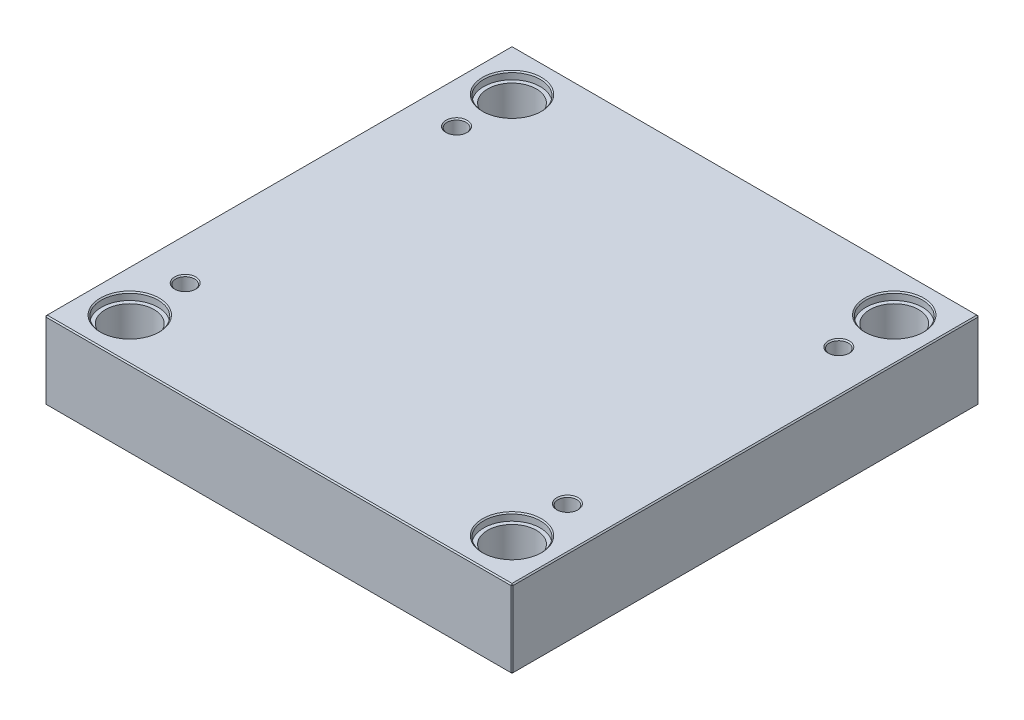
ISO-10303-21;
HEADER;
FILE_DESCRIPTION(('STEP AP214'),'2;1');
FILE_NAME('part.step','',(''),(''),'','','');
FILE_SCHEMA(('AUTOMOTIVE_DESIGN { 1 0 10303 214 1 1 1 1 }'));
ENDSEC;
DATA;
#1=APPLICATION_CONTEXT('core data for automotive mechanical design processes');
#2=APPLICATION_PROTOCOL_DEFINITION('international standard','automotive_design',2000,#1);
#3=PRODUCT_CONTEXT('',#1,'mechanical');
#4=PRODUCT('Part','Part','',(#3));
#5=PRODUCT_RELATED_PRODUCT_CATEGORY('part','',(#4));
#6=PRODUCT_DEFINITION_FORMATION('','',#4);
#7=PRODUCT_DEFINITION_CONTEXT('part definition',#1,'design');
#8=PRODUCT_DEFINITION('design','',#6,#7);
#9=PRODUCT_DEFINITION_SHAPE('','',#8);
#10=(LENGTH_UNIT() NAMED_UNIT(*) SI_UNIT(.MILLI.,.METRE.));
#11=(NAMED_UNIT(*) PLANE_ANGLE_UNIT() SI_UNIT($,.RADIAN.));
#12=(NAMED_UNIT(*) SI_UNIT($,.STERADIAN.) SOLID_ANGLE_UNIT());
#13=UNCERTAINTY_MEASURE_WITH_UNIT(LENGTH_MEASURE(1.E-05),#10,'distance_accuracy_value','');
#14=(GEOMETRIC_REPRESENTATION_CONTEXT(3) GLOBAL_UNCERTAINTY_ASSIGNED_CONTEXT((#13)) GLOBAL_UNIT_ASSIGNED_CONTEXT((#10,
#11,#12)) REPRESENTATION_CONTEXT('',''));
#15=CARTESIAN_POINT('',(0.,0.,0.));
#16=DIRECTION('',(0.,0.,1.));
#17=DIRECTION('',(1.,0.,0.));
#18=AXIS2_PLACEMENT_3D('',#15,#16,#17);
#19=CARTESIAN_POINT('',(-162.,0.,-162.));
#20=DIRECTION('',(0.,1.,0.));
#21=DIRECTION('',(0.,0.,1.));
#22=AXIS2_PLACEMENT_3D('',#19,#20,#21);
#23=CYLINDRICAL_SURFACE('',#22,20.65);
#24=CARTESIAN_POINT('',(-162.,0.999999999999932,-162.));
#25=DIRECTION('',(0.,1.,0.));
#26=DIRECTION('',(0.,0.,1.));
#27=AXIS2_PLACEMENT_3D('',#24,#25,#26);
#28=CIRCLE('',#27,20.65);
#29=CARTESIAN_POINT('',(-162.,0.999999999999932,-141.35));
#30=VERTEX_POINT('',#29);
#31=EDGE_CURVE('E472',#30,#30,#28,.F.);
#32=ORIENTED_EDGE('',*,*,#31,.T.);
#33=EDGE_LOOP('',(#32));
#34=FACE_BOUND('',#33,.T.);
#35=CARTESIAN_POINT('',(-162.,59.7,-162.));
#36=DIRECTION('',(0.,1.,0.));
#37=DIRECTION('',(0.,0.,1.));
#38=AXIS2_PLACEMENT_3D('',#35,#36,#37);
#39=CIRCLE('',#38,20.65);
#40=CARTESIAN_POINT('',(-162.,59.7,-141.35));
#41=VERTEX_POINT('',#40);
#42=EDGE_CURVE('E221',#41,#41,#39,.F.);
#43=ORIENTED_EDGE('',*,*,#42,.F.);
#44=EDGE_LOOP('',(#43));
#45=FACE_BOUND('',#44,.T.);
#46=ADVANCED_FACE('F16',(#34,#45),#23,.F.);
#47=CARTESIAN_POINT('',(162.,0.,-162.));
#48=DIRECTION('',(0.,1.,0.));
#49=DIRECTION('',(0.,0.,1.));
#50=AXIS2_PLACEMENT_3D('',#47,#48,#49);
#51=CYLINDRICAL_SURFACE('',#50,20.65);
#52=CARTESIAN_POINT('',(162.,0.999999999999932,-162.));
#53=DIRECTION('',(0.,1.,0.));
#54=DIRECTION('',(0.,0.,1.));
#55=AXIS2_PLACEMENT_3D('',#52,#53,#54);
#56=CIRCLE('',#55,20.65);
#57=CARTESIAN_POINT('',(162.,0.999999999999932,-141.35));
#58=VERTEX_POINT('',#57);
#59=EDGE_CURVE('E474',#58,#58,#56,.F.);
#60=ORIENTED_EDGE('',*,*,#59,.T.);
#61=EDGE_LOOP('',(#60));
#62=FACE_BOUND('',#61,.T.);
#63=CARTESIAN_POINT('',(162.,59.7,-162.));
#64=DIRECTION('',(0.,1.,0.));
#65=DIRECTION('',(0.,0.,1.));
#66=AXIS2_PLACEMENT_3D('',#63,#64,#65);
#67=CIRCLE('',#66,20.65);
#68=CARTESIAN_POINT('',(162.,59.7,-141.35));
#69=VERTEX_POINT('',#68);
#70=EDGE_CURVE('E218',#69,#69,#67,.F.);
#71=ORIENTED_EDGE('',*,*,#70,.F.);
#72=EDGE_LOOP('',(#71));
#73=FACE_BOUND('',#72,.T.);
#74=ADVANCED_FACE('F263',(#62,#73),#51,.F.);
#75=CARTESIAN_POINT('',(162.,0.,162.));
#76=DIRECTION('',(0.,1.,0.));
#77=DIRECTION('',(0.,0.,1.));
#78=AXIS2_PLACEMENT_3D('',#75,#76,#77);
#79=CYLINDRICAL_SURFACE('',#78,20.65);
#80=CARTESIAN_POINT('',(162.,0.999999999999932,162.));
#81=DIRECTION('',(0.,1.,0.));
#82=DIRECTION('',(0.,0.,1.));
#83=AXIS2_PLACEMENT_3D('',#80,#81,#82);
#84=CIRCLE('',#83,20.65);
#85=CARTESIAN_POINT('',(162.,0.999999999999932,182.65));
#86=VERTEX_POINT('',#85);
#87=EDGE_CURVE('E477',#86,#86,#84,.F.);
#88=ORIENTED_EDGE('',*,*,#87,.T.);
#89=EDGE_LOOP('',(#88));
#90=FACE_BOUND('',#89,.T.);
#91=CARTESIAN_POINT('',(162.,59.7,162.));
#92=DIRECTION('',(0.,1.,0.));
#93=DIRECTION('',(0.,0.,1.));
#94=AXIS2_PLACEMENT_3D('',#91,#92,#93);
#95=CIRCLE('',#94,20.65);
#96=CARTESIAN_POINT('',(162.,59.7,182.65));
#97=VERTEX_POINT('',#96);
#98=EDGE_CURVE('E214',#97,#97,#95,.F.);
#99=ORIENTED_EDGE('',*,*,#98,.F.);
#100=EDGE_LOOP('',(#99));
#101=FACE_BOUND('',#100,.T.);
#102=ADVANCED_FACE('F270',(#90,#101),#79,.F.);
#103=CARTESIAN_POINT('',(-162.,0.,162.));
#104=DIRECTION('',(0.,1.,0.));
#105=DIRECTION('',(0.,0.,1.));
#106=AXIS2_PLACEMENT_3D('',#103,#104,#105);
#107=CYLINDRICAL_SURFACE('',#106,20.65);
#108=CARTESIAN_POINT('',(-162.,0.999999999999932,162.));
#109=DIRECTION('',(0.,1.,0.));
#110=DIRECTION('',(0.,0.,1.));
#111=AXIS2_PLACEMENT_3D('',#108,#109,#110);
#112=CIRCLE('',#111,20.65);
#113=CARTESIAN_POINT('',(-162.,0.999999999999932,182.65));
#114=VERTEX_POINT('',#113);
#115=EDGE_CURVE('E480',#114,#114,#112,.F.);
#116=ORIENTED_EDGE('',*,*,#115,.T.);
#117=EDGE_LOOP('',(#116));
#118=FACE_BOUND('',#117,.T.);
#119=CARTESIAN_POINT('',(-162.,59.7,162.));
#120=DIRECTION('',(0.,1.,0.));
#121=DIRECTION('',(0.,0.,1.));
#122=AXIS2_PLACEMENT_3D('',#119,#120,#121);
#123=CIRCLE('',#122,20.65);
#124=CARTESIAN_POINT('',(-162.,59.7,182.65));
#125=VERTEX_POINT('',#124);
#126=EDGE_CURVE('E211',#125,#125,#123,.F.);
#127=ORIENTED_EDGE('',*,*,#126,.F.);
#128=EDGE_LOOP('',(#127));
#129=FACE_BOUND('',#128,.T.);
#130=ADVANCED_FACE('F277',(#118,#129),#107,.F.);
#131=CARTESIAN_POINT('',(-198.,66.,198.));
#132=DIRECTION('',(1.,0.,0.));
#133=DIRECTION('',(0.,0.,-1.));
#134=AXIS2_PLACEMENT_3D('',#131,#132,#133);
#135=PLANE('',#134);
#136=DIRECTION('',(0.,-1.,0.));
#137=VECTOR('',#136,1.);
#138=CARTESIAN_POINT('',(-198.,66.,-197.));
#139=LINE('',#138,#137);
#140=CARTESIAN_POINT('',(-198.,65.,-197.));
#141=VERTEX_POINT('',#140);
#142=CARTESIAN_POINT('',(-198.,0.999999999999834,-197.));
#143=VERTEX_POINT('',#142);
#144=EDGE_CURVE('E487',#141,#143,#139,.T.);
#145=ORIENTED_EDGE('',*,*,#144,.T.);
#146=DIRECTION('',(0.,0.,1.));
#147=VECTOR('',#146,1.);
#148=CARTESIAN_POINT('',(-198.,0.999999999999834,198.));
#149=LINE('',#148,#147);
#150=CARTESIAN_POINT('',(-198.,0.999999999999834,197.));
#151=VERTEX_POINT('',#150);
#152=EDGE_CURVE('E490',#143,#151,#149,.T.);
#153=ORIENTED_EDGE('',*,*,#152,.T.);
#154=DIRECTION('',(0.,1.,0.));
#155=VECTOR('',#154,1.);
#156=CARTESIAN_POINT('',(-198.,66.,197.));
#157=LINE('',#156,#155);
#158=CARTESIAN_POINT('',(-198.,65.,197.));
#159=VERTEX_POINT('',#158);
#160=EDGE_CURVE('E485',#151,#159,#157,.T.);
#161=ORIENTED_EDGE('',*,*,#160,.T.);
#162=DIRECTION('',(0.,0.,-1.));
#163=VECTOR('',#162,1.);
#164=CARTESIAN_POINT('',(-198.,65.,-198.));
#165=LINE('',#164,#163);
#166=EDGE_CURVE('E483',#159,#141,#165,.T.);
#167=ORIENTED_EDGE('',*,*,#166,.T.);
#168=EDGE_LOOP('',(#145,#153,#161,#167));
#169=FACE_BOUND('',#168,.T.);
#170=ADVANCED_FACE('F298',(#169),#135,.F.);
#171=CARTESIAN_POINT('',(198.,66.,198.));
#172=DIRECTION('',(0.,0.,-1.));
#173=DIRECTION('',(-1.,0.,0.));
#174=AXIS2_PLACEMENT_3D('',#171,#172,#173);
#175=PLANE('',#174);
#176=DIRECTION('',(-1.,0.,0.));
#177=VECTOR('',#176,1.);
#178=CARTESIAN_POINT('',(-198.,65.,198.));
#179=LINE('',#178,#177);
#180=CARTESIAN_POINT('',(197.,65.,198.));
#181=VERTEX_POINT('',#180);
#182=CARTESIAN_POINT('',(-197.,65.,198.));
#183=VERTEX_POINT('',#182);
#184=EDGE_CURVE('E509',#181,#183,#179,.T.);
#185=ORIENTED_EDGE('',*,*,#184,.T.);
#186=DIRECTION('',(0.,-1.,0.));
#187=VECTOR('',#186,1.);
#188=CARTESIAN_POINT('',(-197.,66.,198.));
#189=LINE('',#188,#187);
#190=CARTESIAN_POINT('',(-197.,0.99999999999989,198.));
#191=VERTEX_POINT('',#190);
#192=EDGE_CURVE('E515',#183,#191,#189,.T.);
#193=ORIENTED_EDGE('',*,*,#192,.T.);
#194=DIRECTION('',(1.,0.,0.));
#195=VECTOR('',#194,1.);
#196=CARTESIAN_POINT('',(198.,0.99999999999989,198.));
#197=LINE('',#196,#195);
#198=CARTESIAN_POINT('',(197.,0.99999999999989,198.));
#199=VERTEX_POINT('',#198);
#200=EDGE_CURVE('E513',#191,#199,#197,.T.);
#201=ORIENTED_EDGE('',*,*,#200,.T.);
#202=DIRECTION('',(0.,1.,0.));
#203=VECTOR('',#202,1.);
#204=CARTESIAN_POINT('',(197.,66.,198.));
#205=LINE('',#204,#203);
#206=EDGE_CURVE('E511',#199,#181,#205,.T.);
#207=ORIENTED_EDGE('',*,*,#206,.T.);
#208=EDGE_LOOP('',(#185,#193,#201,#207));
#209=FACE_BOUND('',#208,.T.);
#210=ADVANCED_FACE('F294',(#209),#175,.F.);
#211=CARTESIAN_POINT('',(198.,66.,198.));
#212=DIRECTION('',(-1.,0.,0.));
#213=DIRECTION('',(0.,0.,1.));
#214=AXIS2_PLACEMENT_3D('',#211,#212,#213);
#215=PLANE('',#214);
#216=DIRECTION('',(0.,0.,-1.));
#217=VECTOR('',#216,1.);
#218=CARTESIAN_POINT('',(198.,0.99999999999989,198.));
#219=LINE('',#218,#217);
#220=CARTESIAN_POINT('',(198.,0.99999999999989,197.));
#221=VERTEX_POINT('',#220);
#222=CARTESIAN_POINT('',(198.,0.99999999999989,-197.));
#223=VERTEX_POINT('',#222);
#224=EDGE_CURVE('E504',#221,#223,#219,.T.);
#225=ORIENTED_EDGE('',*,*,#224,.T.);
#226=DIRECTION('',(0.,1.,0.));
#227=VECTOR('',#226,1.);
#228=CARTESIAN_POINT('',(198.,66.,-197.));
#229=LINE('',#228,#227);
#230=CARTESIAN_POINT('',(198.,65.,-197.));
#231=VERTEX_POINT('',#230);
#232=EDGE_CURVE('E506',#223,#231,#229,.T.);
#233=ORIENTED_EDGE('',*,*,#232,.T.);
#234=DIRECTION('',(0.,0.,1.));
#235=VECTOR('',#234,1.);
#236=CARTESIAN_POINT('',(198.,65.,198.));
#237=LINE('',#236,#235);
#238=CARTESIAN_POINT('',(198.,65.,197.));
#239=VERTEX_POINT('',#238);
#240=EDGE_CURVE('E500',#231,#239,#237,.T.);
#241=ORIENTED_EDGE('',*,*,#240,.T.);
#242=DIRECTION('',(0.,-1.,0.));
#243=VECTOR('',#242,1.);
#244=CARTESIAN_POINT('',(198.,66.,197.));
#245=LINE('',#244,#243);
#246=EDGE_CURVE('E502',#239,#221,#245,.T.);
#247=ORIENTED_EDGE('',*,*,#246,.T.);
#248=EDGE_LOOP('',(#225,#233,#241,#247));
#249=FACE_BOUND('',#248,.T.);
#250=ADVANCED_FACE('F290',(#249),#215,.F.);
#251=CARTESIAN_POINT('',(198.,66.,-198.));
#252=DIRECTION('',(0.,0.,1.));
#253=DIRECTION('',(1.,0.,0.));
#254=AXIS2_PLACEMENT_3D('',#251,#252,#253);
#255=PLANE('',#254);
#256=DIRECTION('',(0.,-1.,0.));
#257=VECTOR('',#256,1.);
#258=CARTESIAN_POINT('',(197.,66.,-198.));
#259=LINE('',#258,#257);
#260=CARTESIAN_POINT('',(197.,65.,-198.));
#261=VERTEX_POINT('',#260);
#262=CARTESIAN_POINT('',(197.,0.99999999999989,-198.));
#263=VERTEX_POINT('',#262);
#264=EDGE_CURVE('E494',#261,#263,#259,.T.);
#265=ORIENTED_EDGE('',*,*,#264,.T.);
#266=DIRECTION('',(-1.,0.,0.));
#267=VECTOR('',#266,1.);
#268=CARTESIAN_POINT('',(198.,0.99999999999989,-198.));
#269=LINE('',#268,#267);
#270=CARTESIAN_POINT('',(-197.,0.99999999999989,-198.));
#271=VERTEX_POINT('',#270);
#272=EDGE_CURVE('E138',#263,#271,#269,.T.);
#273=ORIENTED_EDGE('',*,*,#272,.T.);
#274=DIRECTION('',(0.,1.,0.));
#275=VECTOR('',#274,1.);
#276=CARTESIAN_POINT('',(-197.,66.,-198.));
#277=LINE('',#276,#275);
#278=CARTESIAN_POINT('',(-197.,65.,-198.));
#279=VERTEX_POINT('',#278);
#280=EDGE_CURVE('E496',#271,#279,#277,.T.);
#281=ORIENTED_EDGE('',*,*,#280,.T.);
#282=DIRECTION('',(1.,0.,0.));
#283=VECTOR('',#282,1.);
#284=CARTESIAN_POINT('',(198.,65.,-198.));
#285=LINE('',#284,#283);
#286=EDGE_CURVE('E492',#279,#261,#285,.T.);
#287=ORIENTED_EDGE('',*,*,#286,.T.);
#288=EDGE_LOOP('',(#265,#273,#281,#287));
#289=FACE_BOUND('',#288,.T.);
#290=ADVANCED_FACE('F282',(#289),#255,.F.);
#291=CARTESIAN_POINT('',(0.,66.,0.));
#292=DIRECTION('',(0.,1.,0.));
#293=DIRECTION('',(0.,0.,1.));
#294=AXIS2_PLACEMENT_3D('',#291,#292,#293);
#295=PLANE('',#294);
#296=CARTESIAN_POINT('',(162.,66.,162.));
#297=DIRECTION('',(0.,1.,0.));
#298=DIRECTION('',(0.,0.,1.));
#299=AXIS2_PLACEMENT_3D('',#296,#297,#298);
#300=CIRCLE('',#299,25.);
#301=CARTESIAN_POINT('',(162.,66.,187.));
#302=VERTEX_POINT('',#301);
#303=EDGE_CURVE('E236',#302,#302,#300,.F.);
#304=ORIENTED_EDGE('',*,*,#303,.T.);
#305=EDGE_LOOP('',(#304));
#306=FACE_BOUND('',#305,.T.);
#307=CARTESIAN_POINT('',(-162.,66.,162.));
#308=DIRECTION('',(0.,1.,0.));
#309=DIRECTION('',(0.,0.,1.));
#310=AXIS2_PLACEMENT_3D('',#307,#308,#309);
#311=CIRCLE('',#310,25.);
#312=CARTESIAN_POINT('',(-162.,66.,187.));
#313=VERTEX_POINT('',#312);
#314=EDGE_CURVE('E233',#313,#313,#311,.F.);
#315=ORIENTED_EDGE('',*,*,#314,.T.);
#316=EDGE_LOOP('',(#315));
#317=FACE_BOUND('',#316,.T.);
#318=CARTESIAN_POINT('',(162.,66.,-162.));
#319=DIRECTION('',(0.,1.,0.));
#320=DIRECTION('',(0.,0.,1.));
#321=AXIS2_PLACEMENT_3D('',#318,#319,#320);
#322=CIRCLE('',#321,25.);
#323=CARTESIAN_POINT('',(162.,66.,-137.));
#324=VERTEX_POINT('',#323);
#325=EDGE_CURVE('E230',#324,#324,#322,.F.);
#326=ORIENTED_EDGE('',*,*,#325,.T.);
#327=EDGE_LOOP('',(#326));
#328=FACE_BOUND('',#327,.T.);
#329=CARTESIAN_POINT('',(-162.,66.,-162.));
#330=DIRECTION('',(0.,1.,0.));
#331=DIRECTION('',(0.,0.,1.));
#332=AXIS2_PLACEMENT_3D('',#329,#330,#331);
#333=CIRCLE('',#332,25.);
#334=CARTESIAN_POINT('',(-162.,66.,-137.));
#335=VERTEX_POINT('',#334);
#336=EDGE_CURVE('E227',#335,#335,#333,.F.);
#337=ORIENTED_EDGE('',*,*,#336,.T.);
#338=EDGE_LOOP('',(#337));
#339=FACE_BOUND('',#338,.T.);
#340=CARTESIAN_POINT('',(-162.,66.,115.));
#341=DIRECTION('',(0.,1.,0.));
#342=DIRECTION('',(0.,0.,1.));
#343=AXIS2_PLACEMENT_3D('',#340,#341,#342);
#344=CIRCLE('',#343,9.);
#345=CARTESIAN_POINT('',(-162.,66.,124.));
#346=VERTEX_POINT('',#345);
#347=EDGE_CURVE('E198',#346,#346,#344,.F.);
#348=ORIENTED_EDGE('',*,*,#347,.T.);
#349=EDGE_LOOP('',(#348));
#350=FACE_BOUND('',#349,.T.);
#351=CARTESIAN_POINT('',(162.,66.,115.));
#352=DIRECTION('',(0.,1.,0.));
#353=DIRECTION('',(0.,0.,1.));
#354=AXIS2_PLACEMENT_3D('',#351,#352,#353);
#355=CIRCLE('',#354,9.);
#356=CARTESIAN_POINT('',(162.,66.,124.));
#357=VERTEX_POINT('',#356);
#358=EDGE_CURVE('E195',#357,#357,#355,.F.);
#359=ORIENTED_EDGE('',*,*,#358,.T.);
#360=EDGE_LOOP('',(#359));
#361=FACE_BOUND('',#360,.T.);
#362=CARTESIAN_POINT('',(162.,66.,-115.));
#363=DIRECTION('',(0.,1.,0.));
#364=DIRECTION('',(0.,0.,1.));
#365=AXIS2_PLACEMENT_3D('',#362,#363,#364);
#366=CIRCLE('',#365,9.);
#367=CARTESIAN_POINT('',(162.,66.,-106.));
#368=VERTEX_POINT('',#367);
#369=EDGE_CURVE('E192',#368,#368,#366,.F.);
#370=ORIENTED_EDGE('',*,*,#369,.T.);
#371=EDGE_LOOP('',(#370));
#372=FACE_BOUND('',#371,.T.);
#373=CARTESIAN_POINT('',(-162.,66.,-115.));
#374=DIRECTION('',(0.,1.,0.));
#375=DIRECTION('',(0.,0.,1.));
#376=AXIS2_PLACEMENT_3D('',#373,#374,#375);
#377=CIRCLE('',#376,9.);
#378=CARTESIAN_POINT('',(-162.,66.,-106.));
#379=VERTEX_POINT('',#378);
#380=EDGE_CURVE('E188',#379,#379,#377,.F.);
#381=ORIENTED_EDGE('',*,*,#380,.T.);
#382=EDGE_LOOP('',(#381));
#383=FACE_BOUND('',#382,.T.);
#384=DIRECTION('',(0.,0.,-1.));
#385=VECTOR('',#384,1.);
#386=CARTESIAN_POINT('',(197.,66.,-198.));
#387=LINE('',#386,#385);
#388=CARTESIAN_POINT('',(197.,66.,197.));
#389=VERTEX_POINT('',#388);
#390=CARTESIAN_POINT('',(197.,66.,-197.));
#391=VERTEX_POINT('',#390);
#392=EDGE_CURVE('E31',#389,#391,#387,.T.);
#393=ORIENTED_EDGE('',*,*,#392,.T.);
#394=DIRECTION('',(-1.,0.,0.));
#395=VECTOR('',#394,1.);
#396=CARTESIAN_POINT('',(-198.,66.,-197.));
#397=LINE('',#396,#395);
#398=CARTESIAN_POINT('',(-197.,66.,-197.));
#399=VERTEX_POINT('',#398);
#400=EDGE_CURVE('E189',#391,#399,#397,.T.);
#401=ORIENTED_EDGE('',*,*,#400,.T.);
#402=DIRECTION('',(0.,0.,1.));
#403=VECTOR('',#402,1.);
#404=CARTESIAN_POINT('',(-197.,66.,198.));
#405=LINE('',#404,#403);
#406=CARTESIAN_POINT('',(-197.,66.,197.));
#407=VERTEX_POINT('',#406);
#408=EDGE_CURVE('E518',#399,#407,#405,.T.);
#409=ORIENTED_EDGE('',*,*,#408,.T.);
#410=DIRECTION('',(1.,0.,0.));
#411=VECTOR('',#410,1.);
#412=CARTESIAN_POINT('',(198.,66.,197.));
#413=LINE('',#412,#411);
#414=EDGE_CURVE('E36',#407,#389,#413,.T.);
#415=ORIENTED_EDGE('',*,*,#414,.T.);
#416=EDGE_LOOP('',(#393,#401,#409,#415));
#417=FACE_BOUND('',#416,.T.);
#418=ADVANCED_FACE('F279',(#306,#317,#328,#339,#350,#361,#372,#383,#417),#295,.T.);
#419=CARTESIAN_POINT('',(0.,0.,0.));
#420=DIRECTION('',(0.,1.,0.));
#421=DIRECTION('',(0.,0.,1.));
#422=AXIS2_PLACEMENT_3D('',#419,#420,#421);
#423=PLANE('',#422);
#424=CARTESIAN_POINT('',(-162.,0.,-162.));
#425=DIRECTION('',(0.,1.,0.));
#426=DIRECTION('',(0.,0.,1.));
#427=AXIS2_PLACEMENT_3D('',#424,#425,#426);
#428=CIRCLE('',#427,21.65);
#429=CARTESIAN_POINT('',(-162.,0.,-140.35));
#430=VERTEX_POINT('',#429);
#431=EDGE_CURVE('E469',#430,#430,#428,.T.);
#432=ORIENTED_EDGE('',*,*,#431,.T.);
#433=EDGE_LOOP('',(#432));
#434=FACE_BOUND('',#433,.T.);
#435=CARTESIAN_POINT('',(162.,0.,-162.));
#436=DIRECTION('',(0.,1.,0.));
#437=DIRECTION('',(0.,0.,1.));
#438=AXIS2_PLACEMENT_3D('',#435,#436,#437);
#439=CIRCLE('',#438,21.65);
#440=CARTESIAN_POINT('',(162.,0.,-140.35));
#441=VERTEX_POINT('',#440);
#442=EDGE_CURVE('E466',#441,#441,#439,.T.);
#443=ORIENTED_EDGE('',*,*,#442,.T.);
#444=EDGE_LOOP('',(#443));
#445=FACE_BOUND('',#444,.T.);
#446=CARTESIAN_POINT('',(162.,0.,162.));
#447=DIRECTION('',(0.,1.,0.));
#448=DIRECTION('',(0.,0.,1.));
#449=AXIS2_PLACEMENT_3D('',#446,#447,#448);
#450=CIRCLE('',#449,21.65);
#451=CARTESIAN_POINT('',(162.,0.,183.65));
#452=VERTEX_POINT('',#451);
#453=EDGE_CURVE('E463',#452,#452,#450,.T.);
#454=ORIENTED_EDGE('',*,*,#453,.T.);
#455=EDGE_LOOP('',(#454));
#456=FACE_BOUND('',#455,.T.);
#457=CARTESIAN_POINT('',(-162.,0.,162.));
#458=DIRECTION('',(0.,1.,0.));
#459=DIRECTION('',(0.,0.,1.));
#460=AXIS2_PLACEMENT_3D('',#457,#458,#459);
#461=CIRCLE('',#460,21.65);
#462=CARTESIAN_POINT('',(-162.,0.,183.65));
#463=VERTEX_POINT('',#462);
#464=EDGE_CURVE('E460',#463,#463,#461,.T.);
#465=ORIENTED_EDGE('',*,*,#464,.T.);
#466=EDGE_LOOP('',(#465));
#467=FACE_BOUND('',#466,.T.);
#468=DIRECTION('',(0.,0.,1.));
#469=VECTOR('',#468,1.);
#470=CARTESIAN_POINT('',(197.,0.,0.));
#471=LINE('',#470,#469);
#472=CARTESIAN_POINT('',(197.,0.,-197.));
#473=VERTEX_POINT('',#472);
#474=CARTESIAN_POINT('',(197.,0.,197.));
#475=VERTEX_POINT('',#474);
#476=EDGE_CURVE('E108',#473,#475,#471,.T.);
#477=ORIENTED_EDGE('',*,*,#476,.T.);
#478=DIRECTION('',(-1.,0.,0.));
#479=VECTOR('',#478,1.);
#480=CARTESIAN_POINT('',(0.,0.,197.));
#481=LINE('',#480,#479);
#482=CARTESIAN_POINT('',(-197.,0.,197.));
#483=VERTEX_POINT('',#482);
#484=EDGE_CURVE('E458',#475,#483,#481,.T.);
#485=ORIENTED_EDGE('',*,*,#484,.T.);
#486=DIRECTION('',(0.,0.,-1.));
#487=VECTOR('',#486,1.);
#488=CARTESIAN_POINT('',(-197.,0.,0.));
#489=LINE('',#488,#487);
#490=CARTESIAN_POINT('',(-197.,0.,-197.));
#491=VERTEX_POINT('',#490);
#492=EDGE_CURVE('E110',#483,#491,#489,.T.);
#493=ORIENTED_EDGE('',*,*,#492,.T.);
#494=DIRECTION('',(1.,0.,0.));
#495=VECTOR('',#494,1.);
#496=CARTESIAN_POINT('',(0.,0.,-197.));
#497=LINE('',#496,#495);
#498=EDGE_CURVE('E104',#491,#473,#497,.T.);
#499=ORIENTED_EDGE('',*,*,#498,.T.);
#500=EDGE_LOOP('',(#477,#485,#493,#499));
#501=FACE_BOUND('',#500,.T.);
#502=ADVANCED_FACE('F106',(#434,#445,#456,#467,#501),#423,.F.);
#503=CARTESIAN_POINT('',(-162.,0.,-162.));
#504=DIRECTION('',(0.,-1.,0.));
#505=DIRECTION('',(0.,0.,-1.));
#506=AXIS2_PLACEMENT_3D('',#503,#504,#505);
#507=CONICAL_SURFACE('',#506,21.65,0.785398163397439);
#508=ORIENTED_EDGE('',*,*,#31,.F.);
#509=EDGE_LOOP('',(#508));
#510=FACE_BOUND('',#509,.T.);
#511=ORIENTED_EDGE('',*,*,#431,.F.);
#512=EDGE_LOOP('',(#511));
#513=FACE_BOUND('',#512,.T.);
#514=ADVANCED_FACE('F286',(#510,#513),#507,.F.);
#515=CARTESIAN_POINT('',(162.,0.,-162.));
#516=DIRECTION('',(0.,-1.,0.));
#517=DIRECTION('',(0.,0.,-1.));
#518=AXIS2_PLACEMENT_3D('',#515,#516,#517);
#519=CONICAL_SURFACE('',#518,21.65,0.785398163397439);
#520=ORIENTED_EDGE('',*,*,#59,.F.);
#521=EDGE_LOOP('',(#520));
#522=FACE_BOUND('',#521,.T.);
#523=ORIENTED_EDGE('',*,*,#442,.F.);
#524=EDGE_LOOP('',(#523));
#525=FACE_BOUND('',#524,.T.);
#526=ADVANCED_FACE('F305',(#522,#525),#519,.F.);
#527=CARTESIAN_POINT('',(162.,0.,162.));
#528=DIRECTION('',(0.,-1.,0.));
#529=DIRECTION('',(0.,0.,-1.));
#530=AXIS2_PLACEMENT_3D('',#527,#528,#529);
#531=CONICAL_SURFACE('',#530,21.65,0.785398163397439);
#532=ORIENTED_EDGE('',*,*,#87,.F.);
#533=EDGE_LOOP('',(#532));
#534=FACE_BOUND('',#533,.T.);
#535=ORIENTED_EDGE('',*,*,#453,.F.);
#536=EDGE_LOOP('',(#535));
#537=FACE_BOUND('',#536,.T.);
#538=ADVANCED_FACE('F309',(#534,#537),#531,.F.);
#539=CARTESIAN_POINT('',(-162.,0.,162.));
#540=DIRECTION('',(0.,-1.,0.));
#541=DIRECTION('',(0.,0.,-1.));
#542=AXIS2_PLACEMENT_3D('',#539,#540,#541);
#543=CONICAL_SURFACE('',#542,21.65,0.785398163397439);
#544=ORIENTED_EDGE('',*,*,#115,.F.);
#545=EDGE_LOOP('',(#544));
#546=FACE_BOUND('',#545,.T.);
#547=ORIENTED_EDGE('',*,*,#464,.F.);
#548=EDGE_LOOP('',(#547));
#549=FACE_BOUND('',#548,.T.);
#550=ADVANCED_FACE('F313',(#546,#549),#543,.F.);
#551=CARTESIAN_POINT('',(198.,66.,197.));
#552=DIRECTION('',(-0.707106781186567,0.,-0.707106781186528));
#553=DIRECTION('',(0.,-1.,0.));
#554=AXIS2_PLACEMENT_3D('',#551,#552,#553);
#555=PLANE('',#554);
#556=DIRECTION('',(-0.707106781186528,0.,0.707106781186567));
#557=VECTOR('',#556,1.);
#558=CARTESIAN_POINT('',(197.,65.,198.));
#559=LINE('',#558,#557);
#560=EDGE_CURVE('E126',#181,#239,#559,.F.);
#561=ORIENTED_EDGE('',*,*,#560,.F.);
#562=ORIENTED_EDGE('',*,*,#206,.F.);
#563=DIRECTION('',(0.707106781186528,0.,-0.707106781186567));
#564=VECTOR('',#563,1.);
#565=CARTESIAN_POINT('',(197.,0.99999999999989,198.));
#566=LINE('',#565,#564);
#567=EDGE_CURVE('E180',#221,#199,#566,.F.);
#568=ORIENTED_EDGE('',*,*,#567,.F.);
#569=ORIENTED_EDGE('',*,*,#246,.F.);
#570=EDGE_LOOP('',(#561,#562,#568,#569));
#571=FACE_BOUND('',#570,.T.);
#572=ADVANCED_FACE('F317',(#571),#555,.F.);
#573=CARTESIAN_POINT('',(197.,65.,198.));
#574=DIRECTION('',(0.577350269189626,0.577350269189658,0.577350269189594));
#575=DIRECTION('',(-0.707106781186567,0.707106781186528,0.));
#576=AXIS2_PLACEMENT_3D('',#573,#574,#575);
#577=PLANE('',#576);
#578=DIRECTION('',(0.,-0.707106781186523,0.707106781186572));
#579=VECTOR('',#578,1.);
#580=CARTESIAN_POINT('',(197.,65.,198.));
#581=LINE('',#580,#579);
#582=EDGE_CURVE('E175',#181,#389,#581,.F.);
#583=ORIENTED_EDGE('',*,*,#582,.F.);
#584=ORIENTED_EDGE('',*,*,#560,.T.);
#585=DIRECTION('',(-0.707106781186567,0.707106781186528,0.));
#586=VECTOR('',#585,1.);
#587=CARTESIAN_POINT('',(197.5,65.5,197.));
#588=LINE('',#587,#586);
#589=EDGE_CURVE('E177',#389,#239,#588,.F.);
#590=ORIENTED_EDGE('',*,*,#589,.F.);
#591=EDGE_LOOP('',(#583,#584,#590));
#592=FACE_BOUND('',#591,.T.);
#593=ADVANCED_FACE('F385',(#592),#577,.T.);
#594=CARTESIAN_POINT('',(197.,0.99999999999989,198.));
#595=DIRECTION('',(0.577350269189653,-0.577350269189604,0.57735026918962));
#596=DIRECTION('',(0.707106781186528,0.,-0.707106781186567));
#597=AXIS2_PLACEMENT_3D('',#594,#595,#596);
#598=PLANE('',#597);
#599=DIRECTION('',(-0.707106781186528,-0.707106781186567,0.));
#600=VECTOR('',#599,1.);
#601=CARTESIAN_POINT('',(197.5,0.499999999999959,197.));
#602=LINE('',#601,#600);
#603=EDGE_CURVE('E124',#221,#475,#602,.T.);
#604=ORIENTED_EDGE('',*,*,#603,.F.);
#605=ORIENTED_EDGE('',*,*,#567,.T.);
#606=DIRECTION('',(0.,0.707106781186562,0.707106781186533));
#607=VECTOR('',#606,1.);
#608=CARTESIAN_POINT('',(197.,0.99999999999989,198.));
#609=LINE('',#608,#607);
#610=EDGE_CURVE('E172',#475,#199,#609,.T.);
#611=ORIENTED_EDGE('',*,*,#610,.F.);
#612=EDGE_LOOP('',(#604,#605,#611));
#613=FACE_BOUND('',#612,.T.);
#614=ADVANCED_FACE('F381',(#613),#598,.T.);
#615=CARTESIAN_POINT('',(197.,66.,0.));
#616=DIRECTION('',(0.707106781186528,0.707106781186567,0.));
#617=DIRECTION('',(0.,0.,1.));
#618=AXIS2_PLACEMENT_3D('',#615,#616,#617);
#619=PLANE('',#618);
#620=ORIENTED_EDGE('',*,*,#589,.T.);
#621=ORIENTED_EDGE('',*,*,#240,.F.);
#622=DIRECTION('',(0.707106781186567,-0.707106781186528,0.));
#623=VECTOR('',#622,1.);
#624=CARTESIAN_POINT('',(198.,65.,-197.));
#625=LINE('',#624,#623);
#626=EDGE_CURVE('E166',#391,#231,#625,.T.);
#627=ORIENTED_EDGE('',*,*,#626,.F.);
#628=ORIENTED_EDGE('',*,*,#392,.F.);
#629=EDGE_LOOP('',(#620,#621,#627,#628));
#630=FACE_BOUND('',#629,.T.);
#631=ADVANCED_FACE('F377',(#630),#619,.T.);
#632=CARTESIAN_POINT('',(0.,66.,197.));
#633=DIRECTION('',(0.,0.707106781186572,0.707106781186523));
#634=DIRECTION('',(-1.,0.,0.));
#635=AXIS2_PLACEMENT_3D('',#632,#633,#634);
#636=PLANE('',#635);
#637=ORIENTED_EDGE('',*,*,#582,.T.);
#638=ORIENTED_EDGE('',*,*,#414,.F.);
#639=DIRECTION('',(0.,0.707106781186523,-0.707106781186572));
#640=VECTOR('',#639,1.);
#641=CARTESIAN_POINT('',(-197.,65.5,197.5));
#642=LINE('',#641,#640);
#643=EDGE_CURVE('E163',#183,#407,#642,.T.);
#644=ORIENTED_EDGE('',*,*,#643,.F.);
#645=ORIENTED_EDGE('',*,*,#184,.F.);
#646=EDGE_LOOP('',(#637,#638,#644,#645));
#647=FACE_BOUND('',#646,.T.);
#648=ADVANCED_FACE('F373',(#647),#636,.T.);
#649=CARTESIAN_POINT('',(-197.,66.,198.));
#650=DIRECTION('',(0.707106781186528,0.,-0.707106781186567));
#651=DIRECTION('',(0.,-1.,0.));
#652=AXIS2_PLACEMENT_3D('',#649,#650,#651);
#653=PLANE('',#652);
#654=DIRECTION('',(0.707106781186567,0.,0.707106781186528));
#655=VECTOR('',#654,1.);
#656=CARTESIAN_POINT('',(-197.,0.99999999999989,198.));
#657=LINE('',#656,#655);
#658=EDGE_CURVE('E157',#191,#151,#657,.F.);
#659=ORIENTED_EDGE('',*,*,#658,.F.);
#660=ORIENTED_EDGE('',*,*,#192,.F.);
#661=DIRECTION('',(-0.707106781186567,0.,-0.707106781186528));
#662=VECTOR('',#661,1.);
#663=CARTESIAN_POINT('',(-198.,65.,197.));
#664=LINE('',#663,#662);
#665=EDGE_CURVE('E160',#159,#183,#664,.F.);
#666=ORIENTED_EDGE('',*,*,#665,.F.);
#667=ORIENTED_EDGE('',*,*,#160,.F.);
#668=EDGE_LOOP('',(#659,#660,#666,#667));
#669=FACE_BOUND('',#668,.T.);
#670=ADVANCED_FACE('F369',(#669),#653,.F.);
#671=CARTESIAN_POINT('',(198.,0.99999999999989,198.));
#672=DIRECTION('',(0.,0.707106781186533,-0.707106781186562));
#673=DIRECTION('',(1.,0.,0.));
#674=AXIS2_PLACEMENT_3D('',#671,#672,#673);
#675=PLANE('',#674);
#676=ORIENTED_EDGE('',*,*,#610,.T.);
#677=ORIENTED_EDGE('',*,*,#200,.F.);
#678=DIRECTION('',(0.,-0.707106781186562,-0.707106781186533));
#679=VECTOR('',#678,1.);
#680=CARTESIAN_POINT('',(-197.,0.99999999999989,198.));
#681=LINE('',#680,#679);
#682=EDGE_CURVE('E135',#483,#191,#681,.F.);
#683=ORIENTED_EDGE('',*,*,#682,.F.);
#684=ORIENTED_EDGE('',*,*,#484,.F.);
#685=EDGE_LOOP('',(#676,#677,#683,#684));
#686=FACE_BOUND('',#685,.T.);
#687=ADVANCED_FACE('F366',(#686),#675,.F.);
#688=CARTESIAN_POINT('',(198.,0.99999999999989,198.));
#689=DIRECTION('',(-0.707106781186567,0.707106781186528,0.));
#690=DIRECTION('',(0.,0.,-1.));
#691=AXIS2_PLACEMENT_3D('',#688,#689,#690);
#692=PLANE('',#691);
#693=ORIENTED_EDGE('',*,*,#603,.T.);
#694=ORIENTED_EDGE('',*,*,#476,.F.);
#695=DIRECTION('',(0.707106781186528,0.707106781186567,0.));
#696=VECTOR('',#695,1.);
#697=CARTESIAN_POINT('',(197.5,0.499999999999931,-197.));
#698=LINE('',#697,#696);
#699=EDGE_CURVE('E121',#223,#473,#698,.F.);
#700=ORIENTED_EDGE('',*,*,#699,.F.);
#701=ORIENTED_EDGE('',*,*,#224,.F.);
#702=EDGE_LOOP('',(#693,#694,#700,#701));
#703=FACE_BOUND('',#702,.T.);
#704=ADVANCED_FACE('F119',(#703),#692,.F.);
#705=CARTESIAN_POINT('',(197.,66.,-198.));
#706=DIRECTION('',(-0.707106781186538,0.,0.707106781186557));
#707=DIRECTION('',(0.,-1.,0.));
#708=AXIS2_PLACEMENT_3D('',#705,#706,#707);
#709=PLANE('',#708);
#710=DIRECTION('',(0.707106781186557,0.,0.707106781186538));
#711=VECTOR('',#710,1.);
#712=CARTESIAN_POINT('',(198.,65.,-197.));
#713=LINE('',#712,#711);
#714=EDGE_CURVE('E168',#231,#261,#713,.F.);
#715=ORIENTED_EDGE('',*,*,#714,.F.);
#716=ORIENTED_EDGE('',*,*,#232,.F.);
#717=DIRECTION('',(-0.707106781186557,0.,-0.707106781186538));
#718=VECTOR('',#717,1.);
#719=CARTESIAN_POINT('',(197.,0.99999999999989,-198.));
#720=LINE('',#719,#718);
#721=EDGE_CURVE('E134',#263,#223,#720,.F.);
#722=ORIENTED_EDGE('',*,*,#721,.F.);
#723=ORIENTED_EDGE('',*,*,#264,.F.);
#724=EDGE_LOOP('',(#715,#716,#722,#723));
#725=FACE_BOUND('',#724,.T.);
#726=ADVANCED_FACE('F359',(#725),#709,.F.);
#727=CARTESIAN_POINT('',(198.,65.,-197.));
#728=DIRECTION('',(0.577350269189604,0.577350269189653,-0.57735026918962));
#729=DIRECTION('',(0.,0.707106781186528,0.707106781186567));
#730=AXIS2_PLACEMENT_3D('',#727,#728,#729);
#731=PLANE('',#730);
#732=ORIENTED_EDGE('',*,*,#626,.T.);
#733=ORIENTED_EDGE('',*,*,#714,.T.);
#734=DIRECTION('',(0.,0.707106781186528,0.707106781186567));
#735=VECTOR('',#734,1.);
#736=CARTESIAN_POINT('',(197.,65.5,-197.5));
#737=LINE('',#736,#735);
#738=EDGE_CURVE('E152',#391,#261,#737,.F.);
#739=ORIENTED_EDGE('',*,*,#738,.F.);
#740=EDGE_LOOP('',(#732,#733,#739));
#741=FACE_BOUND('',#740,.T.);
#742=ADVANCED_FACE('F355',(#741),#731,.T.);
#743=CARTESIAN_POINT('',(-198.,65.,197.));
#744=DIRECTION('',(-0.577350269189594,0.577350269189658,0.577350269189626));
#745=DIRECTION('',(0.,-0.707106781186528,0.707106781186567));
#746=AXIS2_PLACEMENT_3D('',#743,#744,#745);
#747=PLANE('',#746);
#748=ORIENTED_EDGE('',*,*,#665,.T.);
#749=ORIENTED_EDGE('',*,*,#643,.T.);
#750=DIRECTION('',(-0.707106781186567,-0.707106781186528,0.));
#751=VECTOR('',#750,1.);
#752=CARTESIAN_POINT('',(-198.,65.,197.));
#753=LINE('',#752,#751);
#754=EDGE_CURVE('E143',#159,#407,#753,.F.);
#755=ORIENTED_EDGE('',*,*,#754,.F.);
#756=EDGE_LOOP('',(#748,#749,#755));
#757=FACE_BOUND('',#756,.T.);
#758=ADVANCED_FACE('F351',(#757),#747,.T.);
#759=CARTESIAN_POINT('',(-197.,0.99999999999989,198.));
#760=DIRECTION('',(-0.577350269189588,-0.577350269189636,0.577350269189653));
#761=DIRECTION('',(0.,-0.707106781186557,-0.707106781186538));
#762=AXIS2_PLACEMENT_3D('',#759,#760,#761);
#763=PLANE('',#762);
#764=ORIENTED_EDGE('',*,*,#682,.T.);
#765=ORIENTED_EDGE('',*,*,#658,.T.);
#766=DIRECTION('',(-0.707106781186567,0.707106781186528,0.));
#767=VECTOR('',#766,1.);
#768=CARTESIAN_POINT('',(-197.5,0.499999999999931,197.));
#769=LINE('',#768,#767);
#770=EDGE_CURVE('E139',#483,#151,#769,.T.);
#771=ORIENTED_EDGE('',*,*,#770,.F.);
#772=EDGE_LOOP('',(#764,#765,#771));
#773=FACE_BOUND('',#772,.T.);
#774=ADVANCED_FACE('F348',(#773),#763,.T.);
#775=CARTESIAN_POINT('',(197.,0.99999999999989,-198.));
#776=DIRECTION('',(0.577350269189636,-0.577350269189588,-0.577350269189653));
#777=DIRECTION('',(-0.707106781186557,0.,-0.707106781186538));
#778=AXIS2_PLACEMENT_3D('',#775,#776,#777);
#779=PLANE('',#778);
#780=ORIENTED_EDGE('',*,*,#721,.T.);
#781=ORIENTED_EDGE('',*,*,#699,.T.);
#782=DIRECTION('',(0.,-0.707106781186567,0.707106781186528));
#783=VECTOR('',#782,1.);
#784=CARTESIAN_POINT('',(197.,0.99999999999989,-198.));
#785=LINE('',#784,#783);
#786=EDGE_CURVE('E131',#263,#473,#785,.T.);
#787=ORIENTED_EDGE('',*,*,#786,.F.);
#788=EDGE_LOOP('',(#780,#781,#787));
#789=FACE_BOUND('',#788,.T.);
#790=ADVANCED_FACE('F130',(#789),#779,.T.);
#791=CARTESIAN_POINT('',(0.,66.,-197.));
#792=DIRECTION('',(0.,0.707106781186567,-0.707106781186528));
#793=DIRECTION('',(1.,0.,0.));
#794=AXIS2_PLACEMENT_3D('',#791,#792,#793);
#795=PLANE('',#794);
#796=ORIENTED_EDGE('',*,*,#738,.T.);
#797=ORIENTED_EDGE('',*,*,#286,.F.);
#798=DIRECTION('',(0.,-0.707106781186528,-0.707106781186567));
#799=VECTOR('',#798,1.);
#800=CARTESIAN_POINT('',(-197.,65.,-198.));
#801=LINE('',#800,#799);
#802=EDGE_CURVE('E140',#399,#279,#801,.T.);
#803=ORIENTED_EDGE('',*,*,#802,.F.);
#804=ORIENTED_EDGE('',*,*,#400,.F.);
#805=EDGE_LOOP('',(#796,#797,#803,#804));
#806=FACE_BOUND('',#805,.T.);
#807=ADVANCED_FACE('F341',(#806),#795,.T.);
#808=CARTESIAN_POINT('',(-197.,66.,0.));
#809=DIRECTION('',(-0.707106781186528,0.707106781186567,0.));
#810=DIRECTION('',(0.,0.,-1.));
#811=AXIS2_PLACEMENT_3D('',#808,#809,#810);
#812=PLANE('',#811);
#813=ORIENTED_EDGE('',*,*,#754,.T.);
#814=ORIENTED_EDGE('',*,*,#408,.F.);
#815=DIRECTION('',(0.707106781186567,0.707106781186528,0.));
#816=VECTOR('',#815,1.);
#817=CARTESIAN_POINT('',(-197.5,65.5,-197.));
#818=LINE('',#817,#816);
#819=EDGE_CURVE('E146',#141,#399,#818,.T.);
#820=ORIENTED_EDGE('',*,*,#819,.F.);
#821=ORIENTED_EDGE('',*,*,#166,.F.);
#822=EDGE_LOOP('',(#813,#814,#820,#821));
#823=FACE_BOUND('',#822,.T.);
#824=ADVANCED_FACE('F337',(#823),#812,.T.);
#825=CARTESIAN_POINT('',(-198.,0.999999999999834,198.));
#826=DIRECTION('',(0.707106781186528,0.707106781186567,0.));
#827=DIRECTION('',(0.,0.,1.));
#828=AXIS2_PLACEMENT_3D('',#825,#826,#827);
#829=PLANE('',#828);
#830=ORIENTED_EDGE('',*,*,#770,.T.);
#831=ORIENTED_EDGE('',*,*,#152,.F.);
#832=DIRECTION('',(0.707106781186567,-0.707106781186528,0.));
#833=VECTOR('',#832,1.);
#834=CARTESIAN_POINT('',(-198.,0.999999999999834,-197.));
#835=LINE('',#834,#833);
#836=EDGE_CURVE('E529',#491,#143,#835,.F.);
#837=ORIENTED_EDGE('',*,*,#836,.F.);
#838=ORIENTED_EDGE('',*,*,#492,.F.);
#839=EDGE_LOOP('',(#830,#831,#837,#838));
#840=FACE_BOUND('',#839,.T.);
#841=ADVANCED_FACE('F334',(#840),#829,.F.);
#842=CARTESIAN_POINT('',(198.,0.99999999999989,-198.));
#843=DIRECTION('',(0.,0.707106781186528,0.707106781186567));
#844=DIRECTION('',(-1.,0.,0.));
#845=AXIS2_PLACEMENT_3D('',#842,#843,#844);
#846=PLANE('',#845);
#847=ORIENTED_EDGE('',*,*,#786,.T.);
#848=ORIENTED_EDGE('',*,*,#498,.F.);
#849=DIRECTION('',(0.,0.707106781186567,-0.707106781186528));
#850=VECTOR('',#849,1.);
#851=CARTESIAN_POINT('',(-197.,0.499999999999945,-197.5));
#852=LINE('',#851,#850);
#853=EDGE_CURVE('E526',#271,#491,#852,.F.);
#854=ORIENTED_EDGE('',*,*,#853,.F.);
#855=ORIENTED_EDGE('',*,*,#272,.F.);
#856=EDGE_LOOP('',(#847,#848,#854,#855));
#857=FACE_BOUND('',#856,.T.);
#858=ADVANCED_FACE('F137',(#857),#846,.F.);
#859=CARTESIAN_POINT('',(-197.,65.,-198.));
#860=DIRECTION('',(-0.577350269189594,0.577350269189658,-0.577350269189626));
#861=DIRECTION('',(0.,0.707106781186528,0.707106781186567));
#862=AXIS2_PLACEMENT_3D('',#859,#860,#861);
#863=PLANE('',#862);
#864=ORIENTED_EDGE('',*,*,#819,.T.);
#865=ORIENTED_EDGE('',*,*,#802,.T.);
#866=DIRECTION('',(0.707106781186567,0.,-0.707106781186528));
#867=VECTOR('',#866,1.);
#868=CARTESIAN_POINT('',(-197.,65.,-198.));
#869=LINE('',#868,#867);
#870=EDGE_CURVE('E524',#141,#279,#869,.T.);
#871=ORIENTED_EDGE('',*,*,#870,.F.);
#872=EDGE_LOOP('',(#864,#865,#871));
#873=FACE_BOUND('',#872,.T.);
#874=ADVANCED_FACE('F327',(#873),#863,.T.);
#875=CARTESIAN_POINT('',(-198.,0.999999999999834,-197.));
#876=DIRECTION('',(-0.577350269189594,-0.577350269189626,-0.577350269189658));
#877=DIRECTION('',(0.,0.707106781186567,-0.707106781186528));
#878=AXIS2_PLACEMENT_3D('',#875,#876,#877);
#879=PLANE('',#878);
#880=ORIENTED_EDGE('',*,*,#853,.T.);
#881=ORIENTED_EDGE('',*,*,#836,.T.);
#882=DIRECTION('',(-0.707106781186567,0.,0.707106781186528));
#883=VECTOR('',#882,1.);
#884=CARTESIAN_POINT('',(-198.,0.999999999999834,-197.));
#885=LINE('',#884,#883);
#886=EDGE_CURVE('E455',#271,#143,#885,.T.);
#887=ORIENTED_EDGE('',*,*,#886,.F.);
#888=EDGE_LOOP('',(#880,#881,#887));
#889=FACE_BOUND('',#888,.T.);
#890=ADVANCED_FACE('F323',(#889),#879,.T.);
#891=CARTESIAN_POINT('',(-198.,66.,-197.));
#892=DIRECTION('',(0.707106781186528,0.,0.707106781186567));
#893=DIRECTION('',(0.,-1.,0.));
#894=AXIS2_PLACEMENT_3D('',#891,#892,#893);
#895=PLANE('',#894);
#896=ORIENTED_EDGE('',*,*,#870,.T.);
#897=ORIENTED_EDGE('',*,*,#280,.F.);
#898=ORIENTED_EDGE('',*,*,#886,.T.);
#899=ORIENTED_EDGE('',*,*,#144,.F.);
#900=EDGE_LOOP('',(#896,#897,#898,#899));
#901=FACE_BOUND('',#900,.T.);
#902=ADVANCED_FACE('F319',(#901),#895,.F.);
#903=CARTESIAN_POINT('',(-162.,41.,-115.));
#904=DIRECTION('',(0.,1.,0.));
#905=DIRECTION('',(0.,0.,1.));
#906=AXIS2_PLACEMENT_3D('',#903,#904,#905);
#907=CYLINDRICAL_SURFACE('',#906,8.);
#908=CARTESIAN_POINT('',(-162.,65.,-115.));
#909=DIRECTION('',(0.,1.,0.));
#910=DIRECTION('',(0.,0.,1.));
#911=AXIS2_PLACEMENT_3D('',#908,#909,#910);
#912=CIRCLE('',#911,8.);
#913=CARTESIAN_POINT('',(-162.,65.,-107.));
#914=VERTEX_POINT('',#913);
#915=EDGE_CURVE('E207',#914,#914,#912,.T.);
#916=ORIENTED_EDGE('',*,*,#915,.T.);
#917=EDGE_LOOP('',(#916));
#918=FACE_BOUND('',#917,.T.);
#919=CARTESIAN_POINT('',(-162.,41.,-115.));
#920=DIRECTION('',(0.,1.,0.));
#921=DIRECTION('',(0.,0.,1.));
#922=AXIS2_PLACEMENT_3D('',#919,#920,#921);
#923=CIRCLE('',#922,8.);
#924=CARTESIAN_POINT('',(-162.,41.,-107.));
#925=VERTEX_POINT('',#924);
#926=EDGE_CURVE('E448',#925,#925,#923,.T.);
#927=ORIENTED_EDGE('',*,*,#926,.F.);
#928=EDGE_LOOP('',(#927));
#929=FACE_BOUND('',#928,.T.);
#930=ADVANCED_FACE('F322',(#918,#929),#907,.F.);
#931=CARTESIAN_POINT('',(-162.,41.,-115.));
#932=DIRECTION('',(0.,1.,0.));
#933=DIRECTION('',(0.,0.,1.));
#934=AXIS2_PLACEMENT_3D('',#931,#932,#933);
#935=PLANE('',#934);
#936=ORIENTED_EDGE('',*,*,#926,.T.);
#937=EDGE_LOOP('',(#936));
#938=FACE_BOUND('',#937,.T.);
#939=ADVANCED_FACE('F596',(#938),#935,.T.);
#940=CARTESIAN_POINT('',(162.,41.,-115.));
#941=DIRECTION('',(0.,1.,0.));
#942=DIRECTION('',(0.,0.,1.));
#943=AXIS2_PLACEMENT_3D('',#940,#941,#942);
#944=CYLINDRICAL_SURFACE('',#943,8.);
#945=CARTESIAN_POINT('',(162.,65.,-115.));
#946=DIRECTION('',(0.,1.,0.));
#947=DIRECTION('',(0.,0.,1.));
#948=AXIS2_PLACEMENT_3D('',#945,#946,#947);
#949=CIRCLE('',#948,8.);
#950=CARTESIAN_POINT('',(162.,65.,-107.));
#951=VERTEX_POINT('',#950);
#952=EDGE_CURVE('E204',#951,#951,#949,.T.);
#953=ORIENTED_EDGE('',*,*,#952,.T.);
#954=EDGE_LOOP('',(#953));
#955=FACE_BOUND('',#954,.T.);
#956=CARTESIAN_POINT('',(162.,41.,-115.));
#957=DIRECTION('',(0.,1.,0.));
#958=DIRECTION('',(0.,0.,1.));
#959=AXIS2_PLACEMENT_3D('',#956,#957,#958);
#960=CIRCLE('',#959,8.);
#961=CARTESIAN_POINT('',(162.,41.,-107.));
#962=VERTEX_POINT('',#961);
#963=EDGE_CURVE('E445',#962,#962,#960,.T.);
#964=ORIENTED_EDGE('',*,*,#963,.F.);
#965=EDGE_LOOP('',(#964));
#966=FACE_BOUND('',#965,.T.);
#967=ADVANCED_FACE('F592',(#955,#966),#944,.F.);
#968=CARTESIAN_POINT('',(162.,41.,-115.));
#969=DIRECTION('',(0.,1.,0.));
#970=DIRECTION('',(0.,0.,1.));
#971=AXIS2_PLACEMENT_3D('',#968,#969,#970);
#972=PLANE('',#971);
#973=ORIENTED_EDGE('',*,*,#963,.T.);
#974=EDGE_LOOP('',(#973));
#975=FACE_BOUND('',#974,.T.);
#976=ADVANCED_FACE('F588',(#975),#972,.T.);
#977=CARTESIAN_POINT('',(162.,41.,115.));
#978=DIRECTION('',(0.,1.,0.));
#979=DIRECTION('',(0.,0.,1.));
#980=AXIS2_PLACEMENT_3D('',#977,#978,#979);
#981=CYLINDRICAL_SURFACE('',#980,8.);
#982=CARTESIAN_POINT('',(162.,65.,115.));
#983=DIRECTION('',(0.,1.,0.));
#984=DIRECTION('',(0.,0.,1.));
#985=AXIS2_PLACEMENT_3D('',#982,#983,#984);
#986=CIRCLE('',#985,8.);
#987=CARTESIAN_POINT('',(162.,65.,123.));
#988=VERTEX_POINT('',#987);
#989=EDGE_CURVE('E201',#988,#988,#986,.T.);
#990=ORIENTED_EDGE('',*,*,#989,.T.);
#991=EDGE_LOOP('',(#990));
#992=FACE_BOUND('',#991,.T.);
#993=CARTESIAN_POINT('',(162.,41.,115.));
#994=DIRECTION('',(0.,1.,0.));
#995=DIRECTION('',(0.,0.,1.));
#996=AXIS2_PLACEMENT_3D('',#993,#994,#995);
#997=CIRCLE('',#996,8.);
#998=CARTESIAN_POINT('',(162.,41.,123.));
#999=VERTEX_POINT('',#998);
#1000=EDGE_CURVE('E449',#999,#999,#997,.T.);
#1001=ORIENTED_EDGE('',*,*,#1000,.F.);
#1002=EDGE_LOOP('',(#1001));
#1003=FACE_BOUND('',#1002,.T.);
#1004=ADVANCED_FACE('F591',(#992,#1003),#981,.F.);
#1005=CARTESIAN_POINT('',(162.,41.,115.));
#1006=DIRECTION('',(0.,1.,0.));
#1007=DIRECTION('',(0.,0.,1.));
#1008=AXIS2_PLACEMENT_3D('',#1005,#1006,#1007);
#1009=PLANE('',#1008);
#1010=ORIENTED_EDGE('',*,*,#1000,.T.);
#1011=EDGE_LOOP('',(#1010));
#1012=FACE_BOUND('',#1011,.T.);
#1013=ADVANCED_FACE('F598',(#1012),#1009,.T.);
#1014=CARTESIAN_POINT('',(-162.,41.,115.));
#1015=DIRECTION('',(0.,1.,0.));
#1016=DIRECTION('',(0.,0.,1.));
#1017=AXIS2_PLACEMENT_3D('',#1014,#1015,#1016);
#1018=CYLINDRICAL_SURFACE('',#1017,8.);
#1019=CARTESIAN_POINT('',(-162.,65.,115.));
#1020=DIRECTION('',(0.,1.,0.));
#1021=DIRECTION('',(0.,0.,1.));
#1022=AXIS2_PLACEMENT_3D('',#1019,#1020,#1021);
#1023=CIRCLE('',#1022,8.);
#1024=CARTESIAN_POINT('',(-162.,65.,123.));
#1025=VERTEX_POINT('',#1024);
#1026=EDGE_CURVE('E185',#1025,#1025,#1023,.T.);
#1027=ORIENTED_EDGE('',*,*,#1026,.T.);
#1028=EDGE_LOOP('',(#1027));
#1029=FACE_BOUND('',#1028,.T.);
#1030=CARTESIAN_POINT('',(-162.,41.,115.));
#1031=DIRECTION('',(0.,1.,0.));
#1032=DIRECTION('',(0.,0.,1.));
#1033=AXIS2_PLACEMENT_3D('',#1030,#1031,#1032);
#1034=CIRCLE('',#1033,8.);
#1035=CARTESIAN_POINT('',(-162.,41.,123.));
#1036=VERTEX_POINT('',#1035);
#1037=EDGE_CURVE('E224',#1036,#1036,#1034,.T.);
#1038=ORIENTED_EDGE('',*,*,#1037,.F.);
#1039=EDGE_LOOP('',(#1038));
#1040=FACE_BOUND('',#1039,.T.);
#1041=ADVANCED_FACE('F601',(#1029,#1040),#1018,.F.);
#1042=CARTESIAN_POINT('',(-162.,41.,115.));
#1043=DIRECTION('',(0.,1.,0.));
#1044=DIRECTION('',(0.,0.,1.));
#1045=AXIS2_PLACEMENT_3D('',#1042,#1043,#1044);
#1046=PLANE('',#1045);
#1047=ORIENTED_EDGE('',*,*,#1037,.T.);
#1048=EDGE_LOOP('',(#1047));
#1049=FACE_BOUND('',#1048,.T.);
#1050=ADVANCED_FACE('F397',(#1049),#1046,.T.);
#1051=CARTESIAN_POINT('',(-162.,65.,115.));
#1052=DIRECTION('',(0.,1.,0.));
#1053=DIRECTION('',(0.,0.,1.));
#1054=AXIS2_PLACEMENT_3D('',#1051,#1052,#1053);
#1055=CONICAL_SURFACE('',#1054,8.,0.785398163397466);
#1056=ORIENTED_EDGE('',*,*,#347,.F.);
#1057=EDGE_LOOP('',(#1056));
#1058=FACE_BOUND('',#1057,.T.);
#1059=ORIENTED_EDGE('',*,*,#1026,.F.);
#1060=EDGE_LOOP('',(#1059));
#1061=FACE_BOUND('',#1060,.T.);
#1062=ADVANCED_FACE('F393',(#1058,#1061),#1055,.F.);
#1063=CARTESIAN_POINT('',(162.,65.,115.));
#1064=DIRECTION('',(0.,1.,0.));
#1065=DIRECTION('',(0.,0.,1.));
#1066=AXIS2_PLACEMENT_3D('',#1063,#1064,#1065);
#1067=CONICAL_SURFACE('',#1066,8.,0.785398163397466);
#1068=ORIENTED_EDGE('',*,*,#358,.F.);
#1069=EDGE_LOOP('',(#1068));
#1070=FACE_BOUND('',#1069,.T.);
#1071=ORIENTED_EDGE('',*,*,#989,.F.);
#1072=EDGE_LOOP('',(#1071));
#1073=FACE_BOUND('',#1072,.T.);
#1074=ADVANCED_FACE('F396',(#1070,#1073),#1067,.F.);
#1075=CARTESIAN_POINT('',(162.,65.,-115.));
#1076=DIRECTION('',(0.,1.,0.));
#1077=DIRECTION('',(0.,0.,1.));
#1078=AXIS2_PLACEMENT_3D('',#1075,#1076,#1077);
#1079=CONICAL_SURFACE('',#1078,8.,0.785398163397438);
#1080=ORIENTED_EDGE('',*,*,#369,.F.);
#1081=EDGE_LOOP('',(#1080));
#1082=FACE_BOUND('',#1081,.T.);
#1083=ORIENTED_EDGE('',*,*,#952,.F.);
#1084=EDGE_LOOP('',(#1083));
#1085=FACE_BOUND('',#1084,.T.);
#1086=ADVANCED_FACE('F401',(#1082,#1085),#1079,.F.);
#1087=CARTESIAN_POINT('',(-162.,65.,-115.));
#1088=DIRECTION('',(0.,1.,0.));
#1089=DIRECTION('',(0.,0.,1.));
#1090=AXIS2_PLACEMENT_3D('',#1087,#1088,#1089);
#1091=CONICAL_SURFACE('',#1090,8.,0.785398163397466);
#1092=ORIENTED_EDGE('',*,*,#380,.F.);
#1093=EDGE_LOOP('',(#1092));
#1094=FACE_BOUND('',#1093,.T.);
#1095=ORIENTED_EDGE('',*,*,#915,.F.);
#1096=EDGE_LOOP('',(#1095));
#1097=FACE_BOUND('',#1096,.T.);
#1098=ADVANCED_FACE('F405',(#1094,#1097),#1091,.F.);
#1099=CARTESIAN_POINT('',(-162.,59.7,162.));
#1100=DIRECTION('',(0.,1.,0.));
#1101=DIRECTION('',(0.,0.,1.));
#1102=AXIS2_PLACEMENT_3D('',#1099,#1100,#1101);
#1103=PLANE('',#1102);
#1104=CARTESIAN_POINT('',(-162.,59.7,162.));
#1105=DIRECTION('',(0.,1.,0.));
#1106=DIRECTION('',(0.,0.,1.));
#1107=AXIS2_PLACEMENT_3D('',#1104,#1105,#1106);
#1108=CIRCLE('',#1107,24.);
#1109=CARTESIAN_POINT('',(-162.,59.7,186.));
#1110=VERTEX_POINT('',#1109);
#1111=EDGE_CURVE('E436',#1110,#1110,#1108,.T.);
#1112=ORIENTED_EDGE('',*,*,#1111,.T.);
#1113=EDGE_LOOP('',(#1112));
#1114=FACE_BOUND('',#1113,.T.);
#1115=ORIENTED_EDGE('',*,*,#126,.T.);
#1116=EDGE_LOOP('',(#1115));
#1117=FACE_BOUND('',#1116,.T.);
#1118=ADVANCED_FACE('F409',(#1114,#1117),#1103,.T.);
#1119=CARTESIAN_POINT('',(-162.,59.7,162.));
#1120=DIRECTION('',(0.,1.,0.));
#1121=DIRECTION('',(0.,0.,1.));
#1122=AXIS2_PLACEMENT_3D('',#1119,#1120,#1121);
#1123=CYLINDRICAL_SURFACE('',#1122,24.);
#1124=CARTESIAN_POINT('',(-162.,65.,162.));
#1125=DIRECTION('',(0.,1.,0.));
#1126=DIRECTION('',(0.,0.,1.));
#1127=AXIS2_PLACEMENT_3D('',#1124,#1125,#1126);
#1128=CIRCLE('',#1127,24.);
#1129=CARTESIAN_POINT('',(-162.,65.,186.));
#1130=VERTEX_POINT('',#1129);
#1131=EDGE_CURVE('E239',#1130,#1130,#1128,.T.);
#1132=ORIENTED_EDGE('',*,*,#1131,.T.);
#1133=EDGE_LOOP('',(#1132));
#1134=FACE_BOUND('',#1133,.T.);
#1135=ORIENTED_EDGE('',*,*,#1111,.F.);
#1136=EDGE_LOOP('',(#1135));
#1137=FACE_BOUND('',#1136,.T.);
#1138=ADVANCED_FACE('F574',(#1134,#1137),#1123,.F.);
#1139=CARTESIAN_POINT('',(162.,59.7,162.));
#1140=DIRECTION('',(0.,1.,0.));
#1141=DIRECTION('',(0.,0.,1.));
#1142=AXIS2_PLACEMENT_3D('',#1139,#1140,#1141);
#1143=PLANE('',#1142);
#1144=CARTESIAN_POINT('',(162.,59.7,162.));
#1145=DIRECTION('',(0.,1.,0.));
#1146=DIRECTION('',(0.,0.,1.));
#1147=AXIS2_PLACEMENT_3D('',#1144,#1145,#1146);
#1148=CIRCLE('',#1147,24.);
#1149=CARTESIAN_POINT('',(162.,59.7,186.));
#1150=VERTEX_POINT('',#1149);
#1151=EDGE_CURVE('E433',#1150,#1150,#1148,.T.);
#1152=ORIENTED_EDGE('',*,*,#1151,.T.);
#1153=EDGE_LOOP('',(#1152));
#1154=FACE_BOUND('',#1153,.T.);
#1155=ORIENTED_EDGE('',*,*,#98,.T.);
#1156=EDGE_LOOP('',(#1155));
#1157=FACE_BOUND('',#1156,.T.);
#1158=ADVANCED_FACE('F429',(#1154,#1157),#1143,.T.);
#1159=CARTESIAN_POINT('',(162.,59.7,162.));
#1160=DIRECTION('',(0.,1.,0.));
#1161=DIRECTION('',(0.,0.,1.));
#1162=AXIS2_PLACEMENT_3D('',#1159,#1160,#1161);
#1163=CYLINDRICAL_SURFACE('',#1162,24.);
#1164=CARTESIAN_POINT('',(162.,65.,162.));
#1165=DIRECTION('',(0.,1.,0.));
#1166=DIRECTION('',(0.,0.,1.));
#1167=AXIS2_PLACEMENT_3D('',#1164,#1165,#1166);
#1168=CIRCLE('',#1167,24.);
#1169=CARTESIAN_POINT('',(162.,65.,186.));
#1170=VERTEX_POINT('',#1169);
#1171=EDGE_CURVE('E210',#1170,#1170,#1168,.T.);
#1172=ORIENTED_EDGE('',*,*,#1171,.T.);
#1173=EDGE_LOOP('',(#1172));
#1174=FACE_BOUND('',#1173,.T.);
#1175=ORIENTED_EDGE('',*,*,#1151,.F.);
#1176=EDGE_LOOP('',(#1175));
#1177=FACE_BOUND('',#1176,.T.);
#1178=ADVANCED_FACE('F425',(#1174,#1177),#1163,.F.);
#1179=CARTESIAN_POINT('',(162.,59.7,-162.));
#1180=DIRECTION('',(0.,1.,0.));
#1181=DIRECTION('',(0.,0.,1.));
#1182=AXIS2_PLACEMENT_3D('',#1179,#1180,#1181);
#1183=PLANE('',#1182);
#1184=CARTESIAN_POINT('',(162.,59.7,-162.));
#1185=DIRECTION('',(0.,1.,0.));
#1186=DIRECTION('',(0.,0.,1.));
#1187=AXIS2_PLACEMENT_3D('',#1184,#1185,#1186);
#1188=CIRCLE('',#1187,24.);
#1189=CARTESIAN_POINT('',(162.,59.7,-138.));
#1190=VERTEX_POINT('',#1189);
#1191=EDGE_CURVE('E435',#1190,#1190,#1188,.T.);
#1192=ORIENTED_EDGE('',*,*,#1191,.T.);
#1193=EDGE_LOOP('',(#1192));
#1194=FACE_BOUND('',#1193,.T.);
#1195=ORIENTED_EDGE('',*,*,#70,.T.);
#1196=EDGE_LOOP('',(#1195));
#1197=FACE_BOUND('',#1196,.T.);
#1198=ADVANCED_FACE('F428',(#1194,#1197),#1183,.T.);
#1199=CARTESIAN_POINT('',(162.,59.7,-162.));
#1200=DIRECTION('',(0.,1.,0.));
#1201=DIRECTION('',(0.,0.,1.));
#1202=AXIS2_PLACEMENT_3D('',#1199,#1200,#1201);
#1203=CYLINDRICAL_SURFACE('',#1202,24.);
#1204=CARTESIAN_POINT('',(162.,65.,-162.));
#1205=DIRECTION('',(0.,1.,0.));
#1206=DIRECTION('',(0.,0.,1.));
#1207=AXIS2_PLACEMENT_3D('',#1204,#1205,#1206);
#1208=CIRCLE('',#1207,24.);
#1209=CARTESIAN_POINT('',(162.,65.,-138.));
#1210=VERTEX_POINT('',#1209);
#1211=EDGE_CURVE('E24',#1210,#1210,#1208,.T.);
#1212=ORIENTED_EDGE('',*,*,#1211,.T.);
#1213=EDGE_LOOP('',(#1212));
#1214=FACE_BOUND('',#1213,.T.);
#1215=ORIENTED_EDGE('',*,*,#1191,.F.);
#1216=EDGE_LOOP('',(#1215));
#1217=FACE_BOUND('',#1216,.T.);
#1218=ADVANCED_FACE('F244',(#1214,#1217),#1203,.F.);
#1219=CARTESIAN_POINT('',(-162.,59.7,-162.));
#1220=DIRECTION('',(0.,1.,0.));
#1221=DIRECTION('',(0.,0.,1.));
#1222=AXIS2_PLACEMENT_3D('',#1219,#1220,#1221);
#1223=PLANE('',#1222);
#1224=CARTESIAN_POINT('',(-162.,59.7,-162.));
#1225=DIRECTION('',(0.,1.,0.));
#1226=DIRECTION('',(0.,0.,1.));
#1227=AXIS2_PLACEMENT_3D('',#1224,#1225,#1226);
#1228=CIRCLE('',#1227,24.);
#1229=CARTESIAN_POINT('',(-162.,59.7,-138.));
#1230=VERTEX_POINT('',#1229);
#1231=EDGE_CURVE('E215',#1230,#1230,#1228,.T.);
#1232=ORIENTED_EDGE('',*,*,#1231,.T.);
#1233=EDGE_LOOP('',(#1232));
#1234=FACE_BOUND('',#1233,.T.);
#1235=ORIENTED_EDGE('',*,*,#42,.T.);
#1236=EDGE_LOOP('',(#1235));
#1237=FACE_BOUND('',#1236,.T.);
#1238=ADVANCED_FACE('F418',(#1234,#1237),#1223,.T.);
#1239=CARTESIAN_POINT('',(-162.,59.7,-162.));
#1240=DIRECTION('',(0.,1.,0.));
#1241=DIRECTION('',(0.,0.,1.));
#1242=AXIS2_PLACEMENT_3D('',#1239,#1240,#1241);
#1243=CYLINDRICAL_SURFACE('',#1242,24.);
#1244=CARTESIAN_POINT('',(-162.,65.,-162.));
#1245=DIRECTION('',(0.,1.,0.));
#1246=DIRECTION('',(0.,0.,1.));
#1247=AXIS2_PLACEMENT_3D('',#1244,#1245,#1246);
#1248=CIRCLE('',#1247,24.);
#1249=CARTESIAN_POINT('',(-162.,65.,-138.));
#1250=VERTEX_POINT('',#1249);
#1251=EDGE_CURVE('E10',#1250,#1250,#1248,.T.);
#1252=ORIENTED_EDGE('',*,*,#1251,.T.);
#1253=EDGE_LOOP('',(#1252));
#1254=FACE_BOUND('',#1253,.T.);
#1255=ORIENTED_EDGE('',*,*,#1231,.F.);
#1256=EDGE_LOOP('',(#1255));
#1257=FACE_BOUND('',#1256,.T.);
#1258=ADVANCED_FACE('F412',(#1254,#1257),#1243,.F.);
#1259=CARTESIAN_POINT('',(162.,65.,162.));
#1260=DIRECTION('',(0.,1.,0.));
#1261=DIRECTION('',(0.,0.,1.));
#1262=AXIS2_PLACEMENT_3D('',#1259,#1260,#1261);
#1263=CONICAL_SURFACE('',#1262,24.,0.785398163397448);
#1264=ORIENTED_EDGE('',*,*,#303,.F.);
#1265=EDGE_LOOP('',(#1264));
#1266=FACE_BOUND('',#1265,.T.);
#1267=ORIENTED_EDGE('',*,*,#1171,.F.);
#1268=EDGE_LOOP('',(#1267));
#1269=FACE_BOUND('',#1268,.T.);
#1270=ADVANCED_FACE('F258',(#1266,#1269),#1263,.F.);
#1271=CARTESIAN_POINT('',(-162.,65.,162.));
#1272=DIRECTION('',(0.,1.,0.));
#1273=DIRECTION('',(0.,0.,1.));
#1274=AXIS2_PLACEMENT_3D('',#1271,#1272,#1273);
#1275=CONICAL_SURFACE('',#1274,24.,0.785398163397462);
#1276=ORIENTED_EDGE('',*,*,#314,.F.);
#1277=EDGE_LOOP('',(#1276));
#1278=FACE_BOUND('',#1277,.T.);
#1279=ORIENTED_EDGE('',*,*,#1131,.F.);
#1280=EDGE_LOOP('',(#1279));
#1281=FACE_BOUND('',#1280,.T.);
#1282=ADVANCED_FACE('F249',(#1278,#1281),#1275,.F.);
#1283=CARTESIAN_POINT('',(162.,65.,-162.));
#1284=DIRECTION('',(0.,1.,0.));
#1285=DIRECTION('',(0.,0.,1.));
#1286=AXIS2_PLACEMENT_3D('',#1283,#1284,#1285);
#1287=CONICAL_SURFACE('',#1286,24.,0.785398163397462);
#1288=ORIENTED_EDGE('',*,*,#325,.F.);
#1289=EDGE_LOOP('',(#1288));
#1290=FACE_BOUND('',#1289,.T.);
#1291=ORIENTED_EDGE('',*,*,#1211,.F.);
#1292=EDGE_LOOP('',(#1291));
#1293=FACE_BOUND('',#1292,.T.);
#1294=ADVANCED_FACE('F247',(#1290,#1293),#1287,.F.);
#1295=CARTESIAN_POINT('',(-162.,65.,-162.));
#1296=DIRECTION('',(0.,1.,0.));
#1297=DIRECTION('',(0.,0.,1.));
#1298=AXIS2_PLACEMENT_3D('',#1295,#1296,#1297);
#1299=CONICAL_SURFACE('',#1298,24.,0.785398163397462);
#1300=ORIENTED_EDGE('',*,*,#336,.F.);
#1301=EDGE_LOOP('',(#1300));
#1302=FACE_BOUND('',#1301,.T.);
#1303=ORIENTED_EDGE('',*,*,#1251,.F.);
#1304=EDGE_LOOP('',(#1303));
#1305=FACE_BOUND('',#1304,.T.);
#1306=ADVANCED_FACE('F18',(#1302,#1305),#1299,.F.);
#1307=CLOSED_SHELL('',(#46,#74,#102,#130,#170,#210,#250,#290,#418,#502,#514,#526,#538,#550,#572,
#593,#614,#631,#648,#670,#687,#704,#726,#742,#758,#774,#790,#807,#824,#841,#858,#874,#890,#902,
#930,#939,#967,#976,#1004,#1013,#1041,#1050,#1062,#1074,#1086,#1098,#1118,#1138,#1158,#1178,
#1198,#1218,#1238,#1258,#1270,#1282,#1294,#1306));
#1308=MANIFOLD_SOLID_BREP('B1',#1307);
#1309=ADVANCED_BREP_SHAPE_REPRESENTATION('',(#18,#1308),#14);
#1310=SHAPE_DEFINITION_REPRESENTATION(#9,#1309);
ENDSEC;
END-ISO-10303-21;
